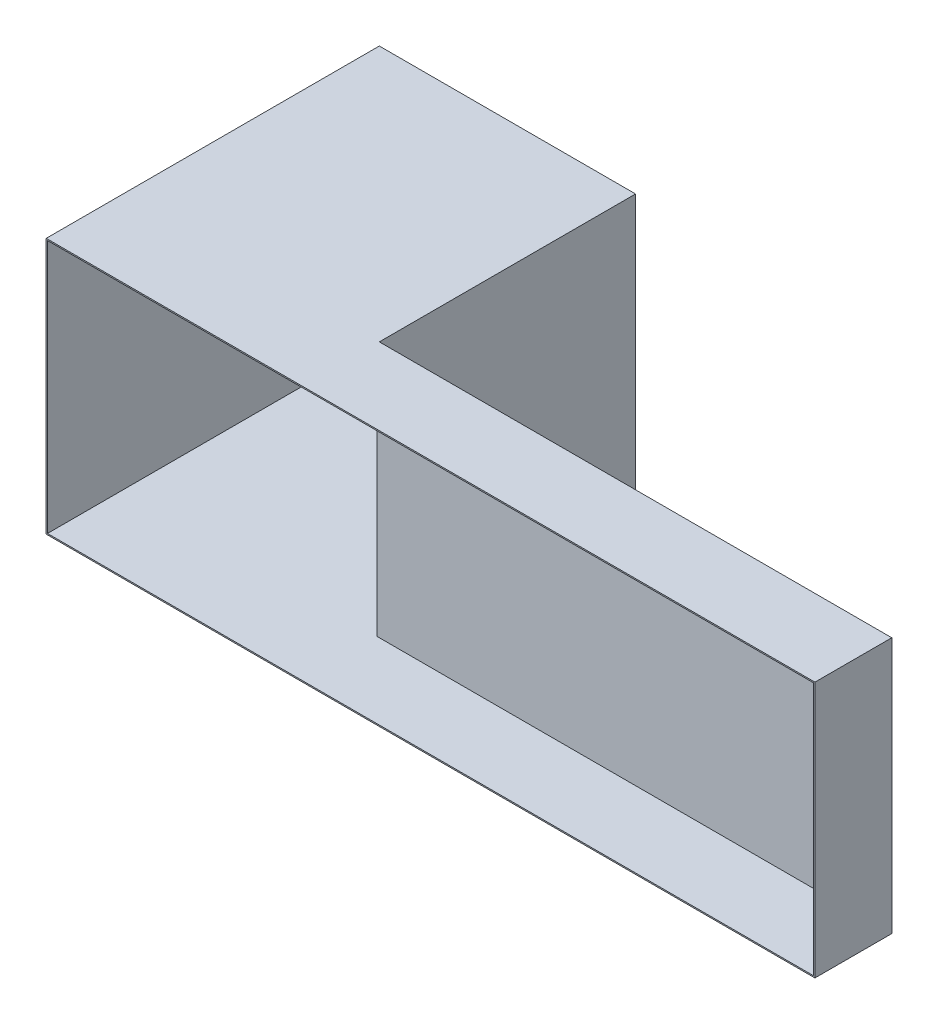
from build123d import *

# Parameters (mm, degrees)
ESQUISSE1_W      = 1500
ESQUISSE1_H      = 500
EXTRUSION1_DEPTH = 150
ESQUISSE2_W      = 500
ESQUISSE2_H      = 500
EXTRUSION2_DEPTH = 500
COQUE1_T         = -2.5


with BuildPart() as part:
    # Esquisse1 → Extrusion1 (new body)
    with BuildSketch(Plane.XY):
        with Locations((750, 0)):
            Rectangle(ESQUISSE1_W, ESQUISSE1_H)
    extrude(amount=EXTRUSION1_DEPTH)

    # Esquisse2 → Extrusion2 (add)
    with BuildSketch(Plane(origin=(0, 0, 0), x_dir=(-1, 0, 0), z_dir=(0, 0, -1))):
        with Locations((-250, 0)):
            Rectangle(ESQUISSE2_W, ESQUISSE2_H)
    extrude(amount=EXTRUSION2_DEPTH)

    # Coque1
    coque1_openings = [part.faces().sort_by_distance(p)[0] for p in [
        (750, 0, 150),
    ]]
    offset(amount=COQUE1_T, openings=coque1_openings, kind=Kind.INTERSECTION)


solid = part.part
